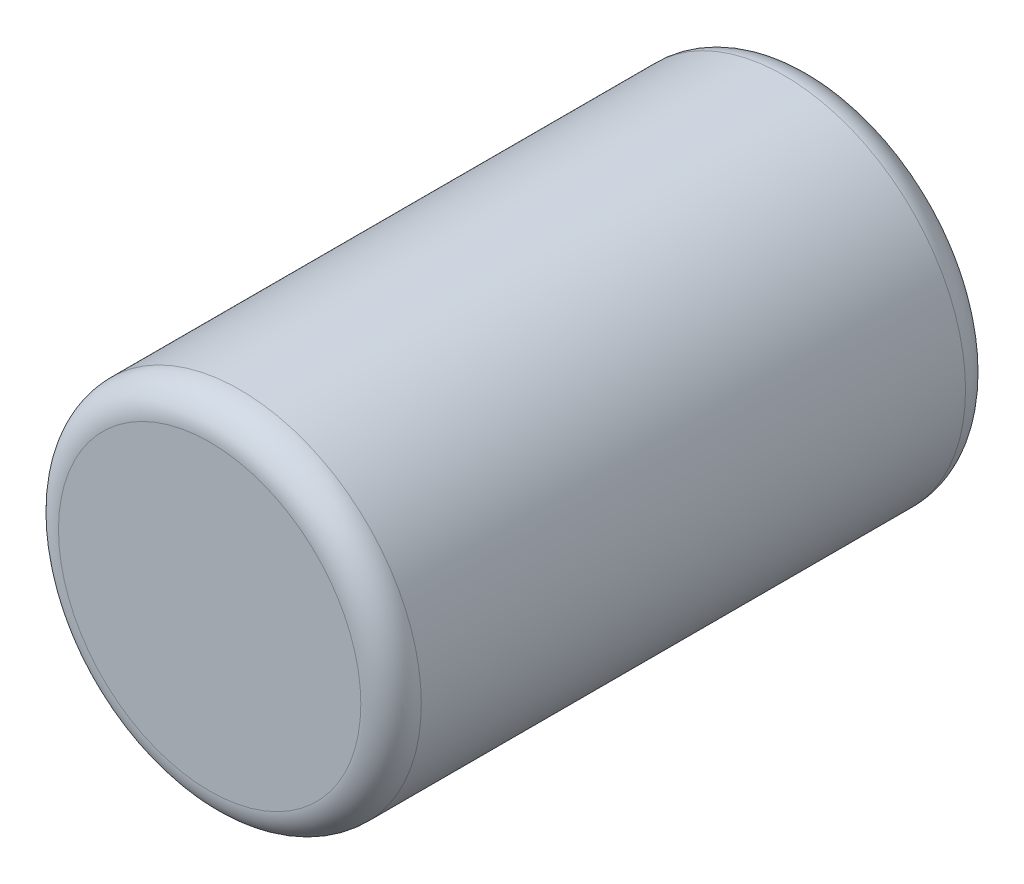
from build123d import *

# Parameters (mm, degrees)
SKETCH_1_R      = 3
EXTRUDE_1_DEPTH = 5
FILLET_1_R      = 0.5


with BuildPart() as part:
    # Sketch 1 → Extrude 1 (new, symmetric)
    with BuildSketch(Plane.XY):
        Circle(SKETCH_1_R)
    extrude(amount=EXTRUDE_1_DEPTH, both=True)

    # Fillet 1
    fillet_1_edges = [part.edges().sort_by_distance(p)[0] for p in [
        (-3, 0, -5),
        (-3, 0, 5),
    ]]
    fillet(fillet_1_edges, radius=FILLET_1_R)


solid = part.part
